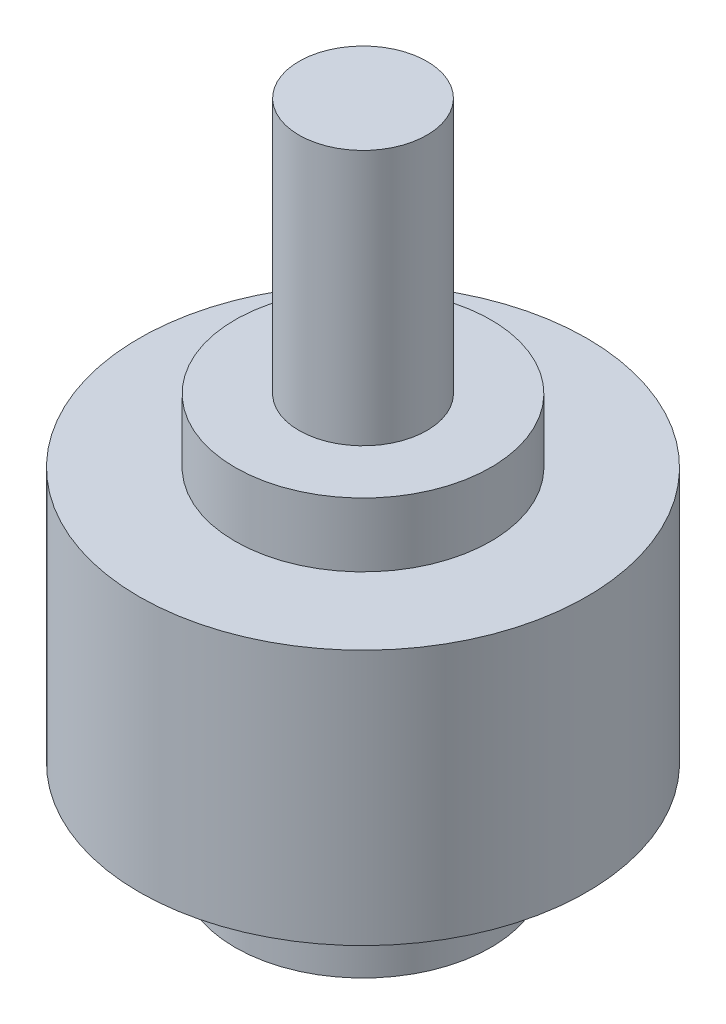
from build123d import *

# Parameters (mm, degrees)
CUT_EXTRUDE1_START = -50.8
SKETCH2_R          = 12.7
CUT_EXTRUDE1_DEPTH = 50.8


with BuildPart() as part:
    # Sketch1 → Base-Revolve (revolve)
    with BuildSketch(Plane.XY, mode=Mode.PRIVATE) as base_revolve_sk:
        Polygon((0, 0), (25.4, 0), (25.4, 19.05), (44.45, 19.05), (44.45, 69.85), (25.4, 69.85), (25.4, 82.55), (12.7, 82.55), (12.7, 133.35), (0, 133.35), align=None)
    revolve(base_revolve_sk.sketch.rotate(Axis((0, 0, 0), (0, -1, 0)), 90), axis=Axis((0, 0, 0), (0, -1, 0)))

    # Sketch2 → Cut-Extrude1 (cut)
    with BuildSketch(Plane.XZ.offset(CUT_EXTRUDE1_START)):
        with Locations(Location((0, 0, 0), (0, 0, 90))):
            Circle(SKETCH2_R)
    extrude(amount=CUT_EXTRUDE1_DEPTH, mode=Mode.SUBTRACT)


solid = part.part
